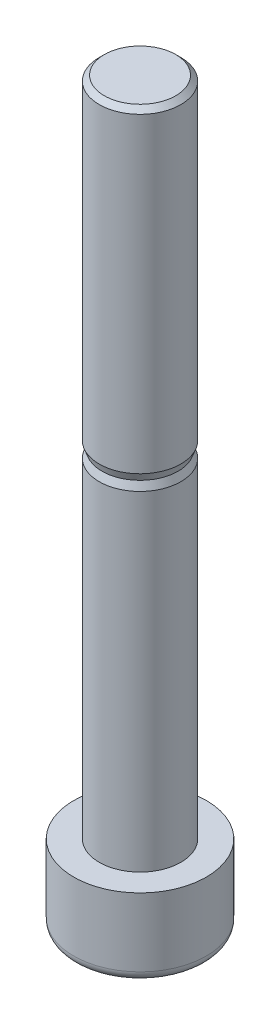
from build123d import *

# Parameters (mm, degrees)
TAGLIO_ESTRUSIONE1_DEPTH = 5
RACCORDO1_R              = 1


with BuildPart() as part:
    # Schizzo1 → Rivoluzione1 (revolve)
    with BuildSketch(Plane(origin=(0, 0, 0), x_dir=(0, 0, -1), z_dir=(1, 0, 0))):
        Polygon((0, 0), (6.5, 0), (6.5, 7.7), (4, 7.7), (4, 40), (3.727022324, 40.75), (4, 41.5), (4, 72), (3.5, 72.5), (0, 72.5), align=None)
    revolve(axis=Axis((0, 0, 0), (0, 1, 0)))

    # Schizzo2 → Taglio-Estrusione1 (cut)
    with BuildSketch(Plane.XZ):
        Polygon((-1.732050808, 3), (-3.464101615, 0), (-1.732050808, -3), (1.732050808, -3), (3.464101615, 0), (1.732050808, 3), align=None)
    extrude(amount=-TAGLIO_ESTRUSIONE1_DEPTH, mode=Mode.SUBTRACT)

    # Raccordo1
    raccordo1_edges = [part.edges().sort_by_distance(p)[0] for p in [
        (0, 0, 6.5),
    ]]
    fillet(raccordo1_edges, radius=RACCORDO1_R)

    # Schizzo3 → Taglia-Rivoluzione2 (revolve, cut)
    with BuildSketch(Plane(origin=(0, 0, 0), x_dir=(0, 0, -1), z_dir=(1, 0, 0)), mode=Mode.PRIVATE) as taglia_rivoluzione2_sk:
        Polygon((-1.5, 0), (-3.5, 0), (-1.5, 0.352653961), align=None)
    revolve(taglia_rivoluzione2_sk.sketch.rotate(Axis((0, 0, 0), (0, -1, 0)), 209.999999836), axis=Axis((0, 0, 0), (0, -1, 0)), mode=Mode.SUBTRACT)


solid = part.part
